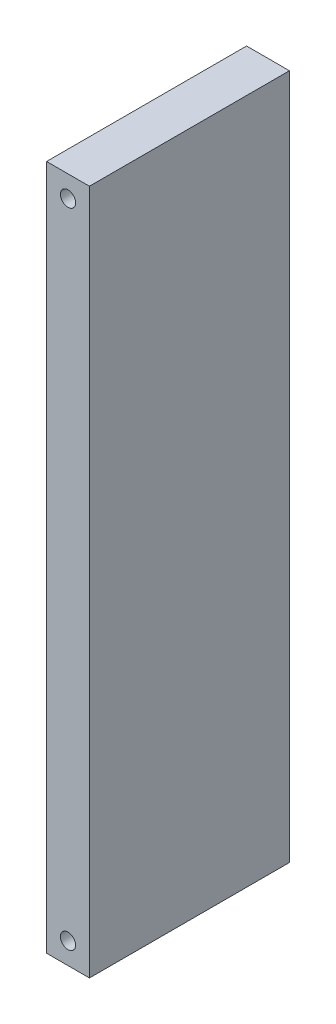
from build123d import *

# Parameters (mm, degrees)
SKETCH1_W           = 38.1
SKETCH1_H           = 609.6
BOSS_EXTRUDE1_DEPTH = 177.8
HOLE1_D             = 13.49502
HOLE1_DEPTH         = 55.626
HOLE1_TIP           = 4.054313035


with BuildPart() as part:
    # Sketch1 → Boss-Extrude1 (new body)
    with BuildSketch(Plane.XY):
        with Locations((-247.65, 0)):
            Rectangle(SKETCH1_W, SKETCH1_H)
    extrude(amount=BOSS_EXTRUDE1_DEPTH)

    # Hole1
    with Locations(Plane(origin=(-261.863455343, -301.982234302, 177.8), x_dir=(1, 0, 0), z_dir=(0, 0, 1))):
        with Locations((14.213455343, 16.232234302), (14.213455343, 587.732234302)):
            Hole(HOLE1_D / 2, depth=HOLE1_DEPTH)
            with Locations((0, 0, -(HOLE1_DEPTH + HOLE1_TIP / 2))):  # 118° drill point
                Cone(0, HOLE1_D / 2, HOLE1_TIP, mode=Mode.SUBTRACT)


solid = part.part
